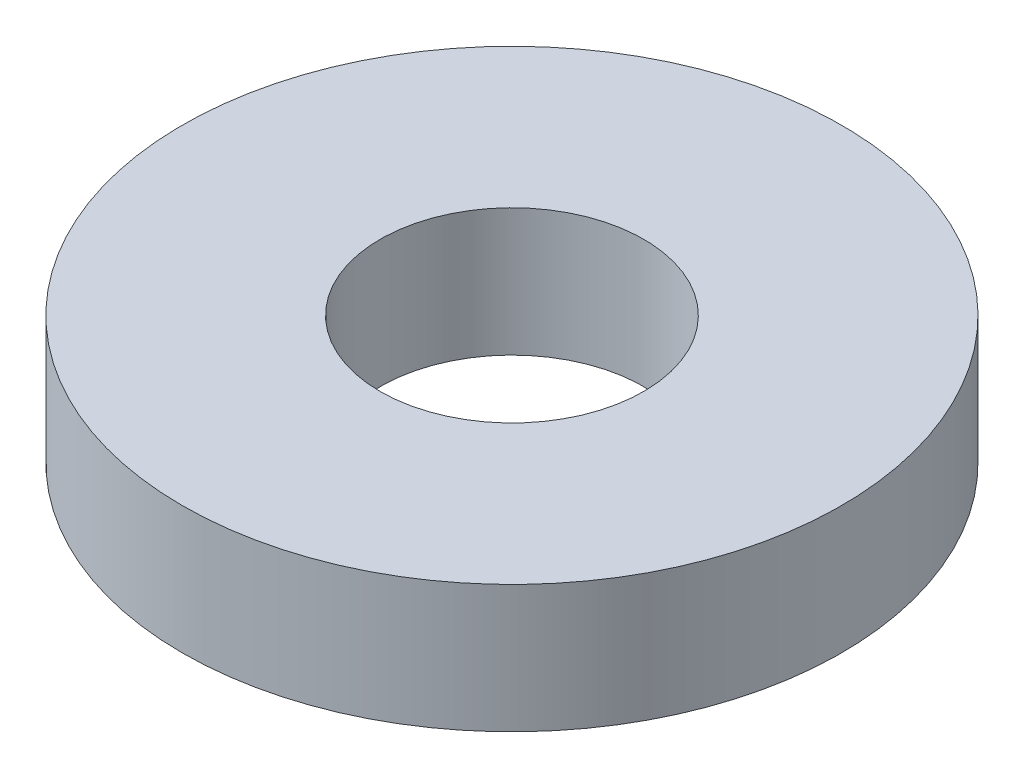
from build123d import *

# Parameters (mm, degrees)
SKETCH1_R           = 7.9375
BOSS_EXTRUDE1_DEPTH = 3.0734
SKETCH5_R           = 3.175
CUT_EXTRUDE1_DEPTH  = 12.638453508


with BuildPart() as part:
    # Sketch1 → Boss-Extrude1 (new body)
    with BuildSketch(Plane(origin=(0, 0, 0), x_dir=(1, 0, 0), z_dir=(0, 1, 0))):
        with Locations(Location((0, 0, 0), (0, 0, 270))):
            Circle(SKETCH1_R)
    extrude(amount=BOSS_EXTRUDE1_DEPTH)

    # Sketch5 → Cut-Extrude1 (cut, through all)
    with BuildSketch(Plane(origin=(0, 3.0734, 0), x_dir=(-1, 0, 0), z_dir=(0, 1, 0))):
        with Locations(Location((0, 0, 0), (0, 0, 90))):
            Circle(SKETCH5_R)
    extrude(amount=-CUT_EXTRUDE1_DEPTH, mode=Mode.SUBTRACT)


solid = part.part
